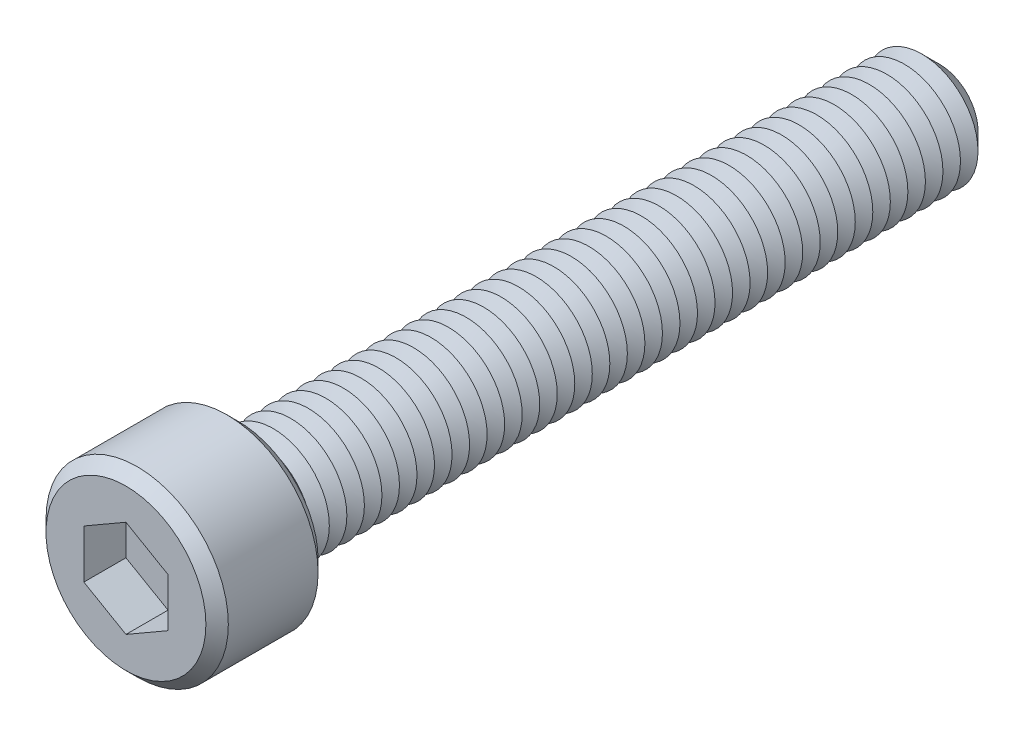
from build123d import *

# Parameters (mm, degrees)
SKETCH1_R           = 6.5
BOSS_EXTRUDE1_DEPTH = 8
SKETCH2_R           = 4
BOSS_EXTRUDE2_DEPTH = 50
CHAMFER1_SIZE       = 1.25
LPATTERN1_COUNT     = 39
LPATTERN1_PITCH     = 1.25
CUT_EXTRUDE1_DEPTH  = 3
SKETCH6_R           = 0.9
CUT_EXTRUDE2_DEPTH  = 55
CHAMFER2_SIZE       = 0.8


with BuildPart() as part:
    # Sketch1 → Boss-Extrude1 (new body)
    with BuildSketch(Plane.XY):
        Circle(SKETCH1_R)
    extrude(amount=BOSS_EXTRUDE1_DEPTH)

    # Sketch2 → Boss-Extrude2 (add)
    with BuildSketch(Plane(origin=(0, 0, 0), x_dir=(-1, 0, 0), z_dir=(0, 0, -1))):
        Circle(SKETCH2_R)
    extrude(amount=BOSS_EXTRUDE2_DEPTH)

    # Chamfer1
    chamfer1_edges = [part.edges().sort_by_distance(p)[0] for p in [
        (4, 0, -50),
    ]]
    chamfer(chamfer1_edges, length=CHAMFER1_SIZE)

    # Sketch4 → Cut-Revolve1 (revolve, cut)
    with BuildSketch(Plane(origin=(0, 0, 0), x_dir=(0, 0, -1), z_dir=(1, 0, 0)), mode=Mode.PRIVATE) as cut_revolve1_sk:
        Polygon((0, 4), (0.625, 2.917468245), (1.25, 4), align=None)
    cut_revolve1 = revolve(cut_revolve1_sk.sketch.rotate(Axis((0, 0, 2.512122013), (0, 0, -1)), 90), axis=Axis((0, 0, 2.512122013), (0, 0, -1)), mode=Mode.SUBTRACT)

    # LPattern1: Cut-Revolve1 ×39
    with Locations(*[(0, 0, -i * LPATTERN1_PITCH) for i in range(1, LPATTERN1_COUNT)]):
        add(cut_revolve1, mode=Mode.SUBTRACT)

    # Sketch5 → Cut-Extrude1 (cut)
    with BuildSketch(Plane.XY.offset(8)):
        Polygon((0, 3.464101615), (-3, 1.732050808), (-3, -1.732050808), (0, -3.464101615), (3, -1.732050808), (3, 1.732050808), align=None)
    extrude(amount=-CUT_EXTRUDE1_DEPTH, mode=Mode.SUBTRACT)

    # Sketch6 → Cut-Extrude2 (cut)
    with BuildSketch(Plane.XY.offset(5)):
        Circle(SKETCH6_R)
    extrude(amount=-CUT_EXTRUDE2_DEPTH, mode=Mode.SUBTRACT)

    # Chamfer2
    chamfer2_edges = [part.edges().sort_by_distance(p)[0] for p in [
        (-6.5, 0, 0),
        (-6.5, 0, 8),
    ]]
    chamfer(chamfer2_edges, length=CHAMFER2_SIZE)


solid = part.part
